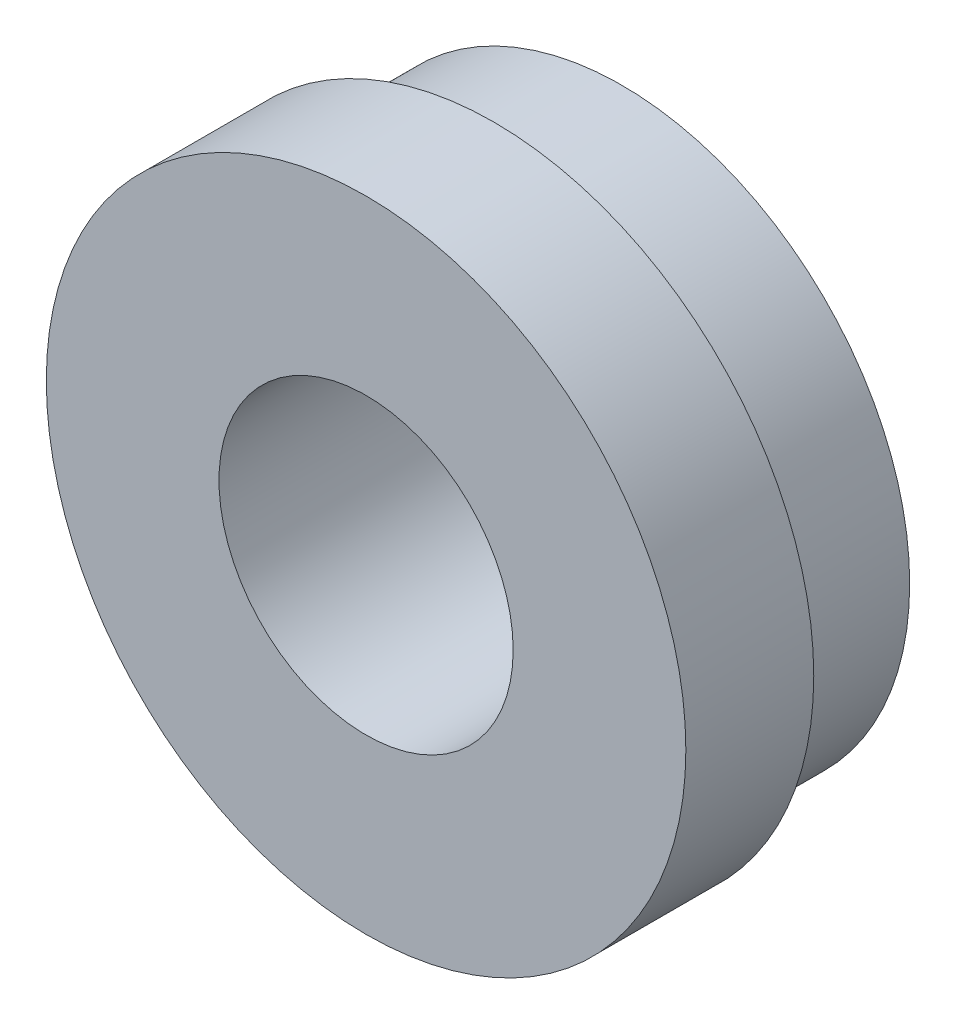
from build123d import *

# Parameters (mm, degrees)
ESQUISSE1_R             = 45
EXTRUSION1_DEPTH        = 20
ESQUISSE2_R             = 50
EXTRUSION2_DEPTH        = 20
ESQUISSE3_R             = 23
ENL_V_MAT_EXTRU_1_DEPTH = 82.240384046


with BuildPart() as part:
    # Esquisse1 → Extrusion1 (new body)
    with BuildSketch(Plane.XY):
        Circle(ESQUISSE1_R)
    extrude(amount=-EXTRUSION1_DEPTH)

    # Esquisse2 → Extrusion2 (add)
    with BuildSketch(Plane.XY):
        Circle(ESQUISSE2_R)
    extrude(amount=EXTRUSION2_DEPTH)

    # Esquisse3 → Enl_v. mat.-Extru.1 (cut, through all)
    with BuildSketch(Plane.XY.offset(20)):
        Circle(ESQUISSE3_R)
    extrude(amount=-ENL_V_MAT_EXTRU_1_DEPTH, mode=Mode.SUBTRACT)


solid = part.part
